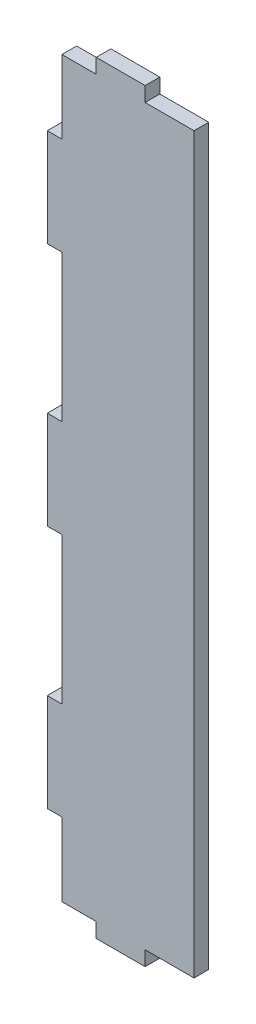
ISO-10303-21;
HEADER;
FILE_DESCRIPTION(('STEP AP214'),'2;1');
FILE_NAME('part.step','',(''),(''),'','','');
FILE_SCHEMA(('AUTOMOTIVE_DESIGN { 1 0 10303 214 1 1 1 1 }'));
ENDSEC;
DATA;
#1=APPLICATION_CONTEXT('core data for automotive mechanical design processes');
#2=APPLICATION_PROTOCOL_DEFINITION('international standard','automotive_design',2000,#1);
#3=PRODUCT_CONTEXT('',#1,'mechanical');
#4=PRODUCT('Part','Part','',(#3));
#5=PRODUCT_RELATED_PRODUCT_CATEGORY('part','',(#4));
#6=PRODUCT_DEFINITION_FORMATION('','',#4);
#7=PRODUCT_DEFINITION_CONTEXT('part definition',#1,'design');
#8=PRODUCT_DEFINITION('design','',#6,#7);
#9=PRODUCT_DEFINITION_SHAPE('','',#8);
#10=(LENGTH_UNIT() NAMED_UNIT(*) SI_UNIT(.MILLI.,.METRE.));
#11=(NAMED_UNIT(*) PLANE_ANGLE_UNIT() SI_UNIT($,.RADIAN.));
#12=(NAMED_UNIT(*) SI_UNIT($,.STERADIAN.) SOLID_ANGLE_UNIT());
#13=UNCERTAINTY_MEASURE_WITH_UNIT(LENGTH_MEASURE(1.E-05),#10,'distance_accuracy_value','');
#14=(GEOMETRIC_REPRESENTATION_CONTEXT(3) GLOBAL_UNCERTAINTY_ASSIGNED_CONTEXT((#13)) GLOBAL_UNIT_ASSIGNED_CONTEXT((#10,
#11,#12)) REPRESENTATION_CONTEXT('',''));
#15=CARTESIAN_POINT('',(0.,0.,0.));
#16=DIRECTION('',(0.,0.,1.));
#17=DIRECTION('',(1.,0.,0.));
#18=AXIS2_PLACEMENT_3D('',#15,#16,#17);
#19=CARTESIAN_POINT('',(-15.,-75.,3.));
#20=DIRECTION('',(1.,0.,0.));
#21=DIRECTION('',(0.,0.,-1.));
#22=AXIS2_PLACEMENT_3D('',#19,#20,#21);
#23=PLANE('',#22);
#24=DIRECTION('',(0.,-1.,0.));
#25=VECTOR('',#24,1.);
#26=CARTESIAN_POINT('',(-15.,-75.,0.));
#27=LINE('',#26,#25);
#28=CARTESIAN_POINT('',(-15.,60.,0.));
#29=VERTEX_POINT('',#28);
#30=CARTESIAN_POINT('',(-15.,40.,0.));
#31=VERTEX_POINT('',#30);
#32=EDGE_CURVE('E219',#29,#31,#27,.T.);
#33=ORIENTED_EDGE('',*,*,#32,.T.);
#34=DIRECTION('',(0.,0.,1.));
#35=VECTOR('',#34,1.);
#36=CARTESIAN_POINT('',(-15.,40.,0.));
#37=LINE('',#36,#35);
#38=CARTESIAN_POINT('',(-15.,40.,3.));
#39=VERTEX_POINT('',#38);
#40=EDGE_CURVE('E417',#31,#39,#37,.T.);
#41=ORIENTED_EDGE('',*,*,#40,.T.);
#42=DIRECTION('',(0.,-1.,0.));
#43=VECTOR('',#42,1.);
#44=CARTESIAN_POINT('',(-15.,-75.,3.));
#45=LINE('',#44,#43);
#46=CARTESIAN_POINT('',(-15.,60.,3.));
#47=VERTEX_POINT('',#46);
#48=EDGE_CURVE('E244',#47,#39,#45,.T.);
#49=ORIENTED_EDGE('',*,*,#48,.F.);
#50=DIRECTION('',(0.,0.,1.));
#51=VECTOR('',#50,1.);
#52=CARTESIAN_POINT('',(-15.,60.,0.));
#53=LINE('',#52,#51);
#54=EDGE_CURVE('E287',#29,#47,#53,.T.);
#55=ORIENTED_EDGE('',*,*,#54,.F.);
#56=EDGE_LOOP('',(#33,#41,#49,#55));
#57=FACE_BOUND('',#56,.T.);
#58=ADVANCED_FACE('F35',(#57),#23,.F.);
#59=CARTESIAN_POINT('',(-15.,-39.9999999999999,3.));
#60=VERTEX_POINT('',#59);
#61=CARTESIAN_POINT('',(-15.,-60.,3.));
#62=VERTEX_POINT('',#61);
#63=EDGE_CURVE('E267',#60,#62,#45,.T.);
#64=ORIENTED_EDGE('',*,*,#63,.F.);
#65=DIRECTION('',(0.,0.,1.));
#66=VECTOR('',#65,1.);
#67=CARTESIAN_POINT('',(-15.,-39.9999999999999,0.));
#68=LINE('',#67,#66);
#69=CARTESIAN_POINT('',(-15.,-39.9999999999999,0.));
#70=VERTEX_POINT('',#69);
#71=EDGE_CURVE('E444',#70,#60,#68,.T.);
#72=ORIENTED_EDGE('',*,*,#71,.F.);
#73=CARTESIAN_POINT('',(-15.,-60.,0.));
#74=VERTEX_POINT('',#73);
#75=EDGE_CURVE('E220',#70,#74,#27,.T.);
#76=ORIENTED_EDGE('',*,*,#75,.T.);
#77=DIRECTION('',(0.,0.,1.));
#78=VECTOR('',#77,1.);
#79=CARTESIAN_POINT('',(-15.,-60.,0.));
#80=LINE('',#79,#78);
#81=EDGE_CURVE('E405',#74,#62,#80,.T.);
#82=ORIENTED_EDGE('',*,*,#81,.T.);
#83=EDGE_LOOP('',(#64,#72,#76,#82));
#84=FACE_BOUND('',#83,.T.);
#85=ADVANCED_FACE('F352',(#84),#23,.F.);
#86=CARTESIAN_POINT('',(-15.,-75.,3.));
#87=DIRECTION('',(0.,1.,0.));
#88=DIRECTION('',(0.,0.,1.));
#89=AXIS2_PLACEMENT_3D('',#86,#87,#88);
#90=PLANE('',#89);
#91=DIRECTION('',(1.,0.,0.));
#92=VECTOR('',#91,1.);
#93=CARTESIAN_POINT('',(-15.,-75.,3.));
#94=LINE('',#93,#92);
#95=CARTESIAN_POINT('',(-12.,-75.,3.));
#96=VERTEX_POINT('',#95);
#97=CARTESIAN_POINT('',(-5.,-75.,3.));
#98=VERTEX_POINT('',#97);
#99=EDGE_CURVE('E232',#96,#98,#94,.T.);
#100=ORIENTED_EDGE('',*,*,#99,.F.);
#101=DIRECTION('',(0.,0.,1.));
#102=VECTOR('',#101,1.);
#103=CARTESIAN_POINT('',(-12.,-75.,0.));
#104=LINE('',#103,#102);
#105=CARTESIAN_POINT('',(-12.,-75.,0.));
#106=VERTEX_POINT('',#105);
#107=EDGE_CURVE('E399',#106,#96,#104,.T.);
#108=ORIENTED_EDGE('',*,*,#107,.F.);
#109=DIRECTION('',(1.,0.,0.));
#110=VECTOR('',#109,1.);
#111=CARTESIAN_POINT('',(-15.,-75.,0.));
#112=LINE('',#111,#110);
#113=CARTESIAN_POINT('',(-5.,-75.,0.));
#114=VERTEX_POINT('',#113);
#115=EDGE_CURVE('E229',#106,#114,#112,.T.);
#116=ORIENTED_EDGE('',*,*,#115,.T.);
#117=DIRECTION('',(0.,0.,-1.));
#118=VECTOR('',#117,1.);
#119=CARTESIAN_POINT('',(-5.,-75.,3.));
#120=LINE('',#119,#118);
#121=EDGE_CURVE('E312',#98,#114,#120,.T.);
#122=ORIENTED_EDGE('',*,*,#121,.F.);
#123=EDGE_LOOP('',(#100,#108,#116,#122));
#124=FACE_BOUND('',#123,.T.);
#125=ADVANCED_FACE('F358',(#124),#90,.F.);
#126=CARTESIAN_POINT('',(-15.,75.,3.));
#127=DIRECTION('',(0.,-1.,0.));
#128=DIRECTION('',(0.,0.,-1.));
#129=AXIS2_PLACEMENT_3D('',#126,#127,#128);
#130=PLANE('',#129);
#131=DIRECTION('',(0.,0.,-1.));
#132=VECTOR('',#131,1.);
#133=CARTESIAN_POINT('',(5.,75.,3.));
#134=LINE('',#133,#132);
#135=CARTESIAN_POINT('',(5.,75.,3.));
#136=VERTEX_POINT('',#135);
#137=CARTESIAN_POINT('',(5.,75.,0.));
#138=VERTEX_POINT('',#137);
#139=EDGE_CURVE('E253',#136,#138,#134,.T.);
#140=ORIENTED_EDGE('',*,*,#139,.F.);
#141=DIRECTION('',(-1.,0.,0.));
#142=VECTOR('',#141,1.);
#143=CARTESIAN_POINT('',(-15.,75.,3.));
#144=LINE('',#143,#142);
#145=CARTESIAN_POINT('',(15.,75.,3.));
#146=VERTEX_POINT('',#145);
#147=EDGE_CURVE('E265',#146,#136,#144,.T.);
#148=ORIENTED_EDGE('',*,*,#147,.F.);
#149=DIRECTION('',(0.,0.,-1.));
#150=VECTOR('',#149,1.);
#151=CARTESIAN_POINT('',(15.,75.,3.));
#152=LINE('',#151,#150);
#153=CARTESIAN_POINT('',(15.,75.,0.));
#154=VERTEX_POINT('',#153);
#155=EDGE_CURVE('E11',#146,#154,#152,.T.);
#156=ORIENTED_EDGE('',*,*,#155,.T.);
#157=DIRECTION('',(-1.,0.,0.));
#158=VECTOR('',#157,1.);
#159=CARTESIAN_POINT('',(-15.,75.,0.));
#160=LINE('',#159,#158);
#161=EDGE_CURVE('E225',#154,#138,#160,.T.);
#162=ORIENTED_EDGE('',*,*,#161,.T.);
#163=EDGE_LOOP('',(#140,#148,#156,#162));
#164=FACE_BOUND('',#163,.T.);
#165=ADVANCED_FACE('F368',(#164),#130,.F.);
#166=CARTESIAN_POINT('',(15.,-75.,3.));
#167=DIRECTION('',(-1.,0.,0.));
#168=DIRECTION('',(0.,0.,1.));
#169=AXIS2_PLACEMENT_3D('',#166,#167,#168);
#170=PLANE('',#169);
#171=DIRECTION('',(0.,1.,0.));
#172=VECTOR('',#171,1.);
#173=CARTESIAN_POINT('',(15.,-75.,0.));
#174=LINE('',#173,#172);
#175=CARTESIAN_POINT('',(15.,-75.,0.));
#176=VERTEX_POINT('',#175);
#177=EDGE_CURVE('E247',#176,#154,#174,.T.);
#178=ORIENTED_EDGE('',*,*,#177,.T.);
#179=ORIENTED_EDGE('',*,*,#155,.F.);
#180=DIRECTION('',(0.,1.,0.));
#181=VECTOR('',#180,1.);
#182=CARTESIAN_POINT('',(15.,-75.,3.));
#183=LINE('',#182,#181);
#184=CARTESIAN_POINT('',(15.,-75.,3.));
#185=VERTEX_POINT('',#184);
#186=EDGE_CURVE('E230',#185,#146,#183,.T.);
#187=ORIENTED_EDGE('',*,*,#186,.F.);
#188=DIRECTION('',(0.,0.,-1.));
#189=VECTOR('',#188,1.);
#190=CARTESIAN_POINT('',(15.,-75.,3.));
#191=LINE('',#190,#189);
#192=EDGE_CURVE('E43',#185,#176,#191,.T.);
#193=ORIENTED_EDGE('',*,*,#192,.T.);
#194=EDGE_LOOP('',(#178,#179,#187,#193));
#195=FACE_BOUND('',#194,.T.);
#196=ADVANCED_FACE('F37',(#195),#170,.F.);
#197=CARTESIAN_POINT('',(-5.,75.,0.));
#198=VERTEX_POINT('',#197);
#199=CARTESIAN_POINT('',(-12.,75.,0.));
#200=VERTEX_POINT('',#199);
#201=EDGE_CURVE('E248',#198,#200,#160,.T.);
#202=ORIENTED_EDGE('',*,*,#201,.T.);
#203=DIRECTION('',(0.,0.,1.));
#204=VECTOR('',#203,1.);
#205=CARTESIAN_POINT('',(-12.,75.,0.));
#206=LINE('',#205,#204);
#207=CARTESIAN_POINT('',(-12.,75.,3.));
#208=VERTEX_POINT('',#207);
#209=EDGE_CURVE('E279',#200,#208,#206,.T.);
#210=ORIENTED_EDGE('',*,*,#209,.T.);
#211=CARTESIAN_POINT('',(-5.,75.,3.));
#212=VERTEX_POINT('',#211);
#213=EDGE_CURVE('E264',#212,#208,#144,.T.);
#214=ORIENTED_EDGE('',*,*,#213,.F.);
#215=DIRECTION('',(0.,0.,-1.));
#216=VECTOR('',#215,1.);
#217=CARTESIAN_POINT('',(-5.,75.,3.));
#218=LINE('',#217,#216);
#219=EDGE_CURVE('E249',#212,#198,#218,.T.);
#220=ORIENTED_EDGE('',*,*,#219,.T.);
#221=EDGE_LOOP('',(#202,#210,#214,#220));
#222=FACE_BOUND('',#221,.T.);
#223=ADVANCED_FACE('F278',(#222),#130,.F.);
#224=CARTESIAN_POINT('',(-15.,10.,3.));
#225=VERTEX_POINT('',#224);
#226=CARTESIAN_POINT('',(-15.,-9.99999999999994,3.));
#227=VERTEX_POINT('',#226);
#228=EDGE_CURVE('E213',#225,#227,#45,.T.);
#229=ORIENTED_EDGE('',*,*,#228,.F.);
#230=DIRECTION('',(0.,0.,1.));
#231=VECTOR('',#230,1.);
#232=CARTESIAN_POINT('',(-15.,10.,0.));
#233=LINE('',#232,#231);
#234=CARTESIAN_POINT('',(-15.,10.,0.));
#235=VERTEX_POINT('',#234);
#236=EDGE_CURVE('E199',#235,#225,#233,.T.);
#237=ORIENTED_EDGE('',*,*,#236,.F.);
#238=CARTESIAN_POINT('',(-15.,-9.99999999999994,0.));
#239=VERTEX_POINT('',#238);
#240=EDGE_CURVE('E211',#235,#239,#27,.T.);
#241=ORIENTED_EDGE('',*,*,#240,.T.);
#242=DIRECTION('',(0.,0.,1.));
#243=VECTOR('',#242,1.);
#244=CARTESIAN_POINT('',(-15.,-9.99999999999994,0.));
#245=LINE('',#244,#243);
#246=EDGE_CURVE('E447',#239,#227,#245,.T.);
#247=ORIENTED_EDGE('',*,*,#246,.T.);
#248=EDGE_LOOP('',(#229,#237,#241,#247));
#249=FACE_BOUND('',#248,.T.);
#250=ADVANCED_FACE('F209',(#249),#23,.F.);
#251=CARTESIAN_POINT('',(5.,-75.,3.));
#252=VERTEX_POINT('',#251);
#253=EDGE_CURVE('E238',#252,#185,#94,.T.);
#254=ORIENTED_EDGE('',*,*,#253,.F.);
#255=DIRECTION('',(0.,0.,-1.));
#256=VECTOR('',#255,1.);
#257=CARTESIAN_POINT('',(5.,-75.,3.));
#258=LINE('',#257,#256);
#259=CARTESIAN_POINT('',(5.,-75.,0.));
#260=VERTEX_POINT('',#259);
#261=EDGE_CURVE('E300',#252,#260,#258,.T.);
#262=ORIENTED_EDGE('',*,*,#261,.T.);
#263=EDGE_CURVE('E223',#260,#176,#112,.T.);
#264=ORIENTED_EDGE('',*,*,#263,.T.);
#265=ORIENTED_EDGE('',*,*,#192,.F.);
#266=EDGE_LOOP('',(#254,#262,#264,#265));
#267=FACE_BOUND('',#266,.T.);
#268=ADVANCED_FACE('F362',(#267),#90,.F.);
#269=CARTESIAN_POINT('',(0.,0.,3.));
#270=DIRECTION('',(0.,0.,-1.));
#271=DIRECTION('',(-1.,0.,0.));
#272=AXIS2_PLACEMENT_3D('',#269,#270,#271);
#273=PLANE('',#272);
#274=ORIENTED_EDGE('',*,*,#48,.T.);
#275=DIRECTION('',(-1.,0.,0.));
#276=VECTOR('',#275,1.);
#277=CARTESIAN_POINT('',(-15.,40.,3.));
#278=LINE('',#277,#276);
#279=CARTESIAN_POINT('',(-12.,40.,3.));
#280=VERTEX_POINT('',#279);
#281=EDGE_CURVE('E204',#280,#39,#278,.T.);
#282=ORIENTED_EDGE('',*,*,#281,.F.);
#283=DIRECTION('',(0.,1.,0.));
#284=VECTOR('',#283,1.);
#285=CARTESIAN_POINT('',(-12.,40.,3.));
#286=LINE('',#285,#284);
#287=CARTESIAN_POINT('',(-12.,10.,3.));
#288=VERTEX_POINT('',#287);
#289=EDGE_CURVE('E584',#288,#280,#286,.T.);
#290=ORIENTED_EDGE('',*,*,#289,.F.);
#291=DIRECTION('',(1.,0.,0.));
#292=VECTOR('',#291,1.);
#293=CARTESIAN_POINT('',(-15.,10.,3.));
#294=LINE('',#293,#292);
#295=EDGE_CURVE('E446',#225,#288,#294,.T.);
#296=ORIENTED_EDGE('',*,*,#295,.F.);
#297=ORIENTED_EDGE('',*,*,#228,.T.);
#298=DIRECTION('',(-1.,0.,0.));
#299=VECTOR('',#298,1.);
#300=CARTESIAN_POINT('',(-15.,-9.99999999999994,3.));
#301=LINE('',#300,#299);
#302=CARTESIAN_POINT('',(-12.,-9.99999999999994,3.));
#303=VERTEX_POINT('',#302);
#304=EDGE_CURVE('E433',#303,#227,#301,.T.);
#305=ORIENTED_EDGE('',*,*,#304,.F.);
#306=DIRECTION('',(0.,1.,0.));
#307=VECTOR('',#306,1.);
#308=CARTESIAN_POINT('',(-12.,-39.9999999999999,3.));
#309=LINE('',#308,#307);
#310=CARTESIAN_POINT('',(-12.,-39.9999999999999,3.));
#311=VERTEX_POINT('',#310);
#312=EDGE_CURVE('E440',#311,#303,#309,.T.);
#313=ORIENTED_EDGE('',*,*,#312,.F.);
#314=DIRECTION('',(1.,0.,0.));
#315=VECTOR('',#314,1.);
#316=CARTESIAN_POINT('',(-15.,-39.9999999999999,3.));
#317=LINE('',#316,#315);
#318=EDGE_CURVE('E437',#60,#311,#317,.T.);
#319=ORIENTED_EDGE('',*,*,#318,.F.);
#320=ORIENTED_EDGE('',*,*,#63,.T.);
#321=DIRECTION('',(-1.,0.,0.));
#322=VECTOR('',#321,1.);
#323=CARTESIAN_POINT('',(-15.,-60.,3.));
#324=LINE('',#323,#322);
#325=CARTESIAN_POINT('',(-12.,-60.,3.));
#326=VERTEX_POINT('',#325);
#327=EDGE_CURVE('E452',#326,#62,#324,.T.);
#328=ORIENTED_EDGE('',*,*,#327,.F.);
#329=DIRECTION('',(0.,1.,0.));
#330=VECTOR('',#329,1.);
#331=CARTESIAN_POINT('',(-12.,-75.,3.));
#332=LINE('',#331,#330);
#333=EDGE_CURVE('E454',#96,#326,#332,.T.);
#334=ORIENTED_EDGE('',*,*,#333,.F.);
#335=ORIENTED_EDGE('',*,*,#99,.T.);
#336=DIRECTION('',(0.,-1.,0.));
#337=VECTOR('',#336,1.);
#338=CARTESIAN_POINT('',(-5.,-75.,3.));
#339=LINE('',#338,#337);
#340=CARTESIAN_POINT('',(-5.00000000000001,-78.,3.));
#341=VERTEX_POINT('',#340);
#342=EDGE_CURVE('E294',#98,#341,#339,.T.);
#343=ORIENTED_EDGE('',*,*,#342,.T.);
#344=DIRECTION('',(1.,0.,0.));
#345=VECTOR('',#344,1.);
#346=CARTESIAN_POINT('',(-5.00000000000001,-78.,3.));
#347=LINE('',#346,#345);
#348=CARTESIAN_POINT('',(4.99999999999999,-78.,3.));
#349=VERTEX_POINT('',#348);
#350=EDGE_CURVE('E296',#341,#349,#347,.T.);
#351=ORIENTED_EDGE('',*,*,#350,.T.);
#352=DIRECTION('',(0.,1.,0.));
#353=VECTOR('',#352,1.);
#354=CARTESIAN_POINT('',(5.,-75.,3.));
#355=LINE('',#354,#353);
#356=EDGE_CURVE('E299',#349,#252,#355,.T.);
#357=ORIENTED_EDGE('',*,*,#356,.T.);
#358=ORIENTED_EDGE('',*,*,#253,.T.);
#359=ORIENTED_EDGE('',*,*,#186,.T.);
#360=ORIENTED_EDGE('',*,*,#147,.T.);
#361=DIRECTION('',(0.,1.,0.));
#362=VECTOR('',#361,1.);
#363=CARTESIAN_POINT('',(5.,75.,3.));
#364=LINE('',#363,#362);
#365=CARTESIAN_POINT('',(4.99999999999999,78.,3.));
#366=VERTEX_POINT('',#365);
#367=EDGE_CURVE('E317',#136,#366,#364,.T.);
#368=ORIENTED_EDGE('',*,*,#367,.T.);
#369=DIRECTION('',(-1.,0.,0.));
#370=VECTOR('',#369,1.);
#371=CARTESIAN_POINT('',(-5.00000000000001,78.,3.));
#372=LINE('',#371,#370);
#373=CARTESIAN_POINT('',(-5.00000000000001,78.,3.));
#374=VERTEX_POINT('',#373);
#375=EDGE_CURVE('E320',#366,#374,#372,.T.);
#376=ORIENTED_EDGE('',*,*,#375,.T.);
#377=DIRECTION('',(0.,-1.,0.));
#378=VECTOR('',#377,1.);
#379=CARTESIAN_POINT('',(-5.,75.,3.));
#380=LINE('',#379,#378);
#381=EDGE_CURVE('E276',#374,#212,#380,.T.);
#382=ORIENTED_EDGE('',*,*,#381,.T.);
#383=ORIENTED_EDGE('',*,*,#213,.T.);
#384=DIRECTION('',(0.,1.,0.));
#385=VECTOR('',#384,1.);
#386=CARTESIAN_POINT('',(-12.,75.,3.));
#387=LINE('',#386,#385);
#388=CARTESIAN_POINT('',(-12.,60.,3.));
#389=VERTEX_POINT('',#388);
#390=EDGE_CURVE('E274',#389,#208,#387,.T.);
#391=ORIENTED_EDGE('',*,*,#390,.F.);
#392=DIRECTION('',(1.,0.,0.));
#393=VECTOR('',#392,1.);
#394=CARTESIAN_POINT('',(-15.,60.,3.));
#395=LINE('',#394,#393);
#396=EDGE_CURVE('E415',#47,#389,#395,.T.);
#397=ORIENTED_EDGE('',*,*,#396,.F.);
#398=EDGE_LOOP('',(#274,#282,#290,#296,#297,#305,#313,#319,#320,#328,#334,#335,#343,#351,#357,
#358,#359,#360,#368,#376,#382,#383,#391,#397));
#399=FACE_BOUND('',#398,.T.);
#400=ADVANCED_FACE('F272',(#399),#273,.F.);
#401=CARTESIAN_POINT('',(0.,0.,0.));
#402=DIRECTION('',(0.,0.,-1.));
#403=DIRECTION('',(-1.,0.,0.));
#404=AXIS2_PLACEMENT_3D('',#401,#402,#403);
#405=PLANE('',#404);
#406=DIRECTION('',(-1.,0.,0.));
#407=VECTOR('',#406,1.);
#408=CARTESIAN_POINT('',(-15.,40.,0.));
#409=LINE('',#408,#407);
#410=CARTESIAN_POINT('',(-12.,40.,0.));
#411=VERTEX_POINT('',#410);
#412=EDGE_CURVE('E214',#411,#31,#409,.T.);
#413=ORIENTED_EDGE('',*,*,#412,.T.);
#414=ORIENTED_EDGE('',*,*,#32,.F.);
#415=DIRECTION('',(1.,0.,0.));
#416=VECTOR('',#415,1.);
#417=CARTESIAN_POINT('',(-15.,60.,0.));
#418=LINE('',#417,#416);
#419=CARTESIAN_POINT('',(-12.,60.,0.));
#420=VERTEX_POINT('',#419);
#421=EDGE_CURVE('E412',#29,#420,#418,.T.);
#422=ORIENTED_EDGE('',*,*,#421,.T.);
#423=DIRECTION('',(0.,1.,0.));
#424=VECTOR('',#423,1.);
#425=CARTESIAN_POINT('',(-12.,75.,0.));
#426=LINE('',#425,#424);
#427=EDGE_CURVE('E293',#420,#200,#426,.T.);
#428=ORIENTED_EDGE('',*,*,#427,.T.);
#429=ORIENTED_EDGE('',*,*,#201,.F.);
#430=DIRECTION('',(0.,-1.,0.));
#431=VECTOR('',#430,1.);
#432=CARTESIAN_POINT('',(-5.,75.,0.));
#433=LINE('',#432,#431);
#434=CARTESIAN_POINT('',(-5.00000000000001,78.,0.));
#435=VERTEX_POINT('',#434);
#436=EDGE_CURVE('E315',#435,#198,#433,.T.);
#437=ORIENTED_EDGE('',*,*,#436,.F.);
#438=DIRECTION('',(-1.,0.,0.));
#439=VECTOR('',#438,1.);
#440=CARTESIAN_POINT('',(-5.00000000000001,78.,0.));
#441=LINE('',#440,#439);
#442=CARTESIAN_POINT('',(4.99999999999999,78.,0.));
#443=VERTEX_POINT('',#442);
#444=EDGE_CURVE('E318',#443,#435,#441,.T.);
#445=ORIENTED_EDGE('',*,*,#444,.F.);
#446=DIRECTION('',(0.,1.,0.));
#447=VECTOR('',#446,1.);
#448=CARTESIAN_POINT('',(5.,75.,0.));
#449=LINE('',#448,#447);
#450=EDGE_CURVE('E324',#138,#443,#449,.T.);
#451=ORIENTED_EDGE('',*,*,#450,.F.);
#452=ORIENTED_EDGE('',*,*,#161,.F.);
#453=ORIENTED_EDGE('',*,*,#177,.F.);
#454=ORIENTED_EDGE('',*,*,#263,.F.);
#455=DIRECTION('',(0.,1.,0.));
#456=VECTOR('',#455,1.);
#457=CARTESIAN_POINT('',(5.,-75.,0.));
#458=LINE('',#457,#456);
#459=CARTESIAN_POINT('',(4.99999999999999,-78.,0.));
#460=VERTEX_POINT('',#459);
#461=EDGE_CURVE('E297',#460,#260,#458,.T.);
#462=ORIENTED_EDGE('',*,*,#461,.F.);
#463=DIRECTION('',(1.,0.,0.));
#464=VECTOR('',#463,1.);
#465=CARTESIAN_POINT('',(-5.00000000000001,-78.,0.));
#466=LINE('',#465,#464);
#467=CARTESIAN_POINT('',(-5.00000000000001,-78.,0.));
#468=VERTEX_POINT('',#467);
#469=EDGE_CURVE('E285',#468,#460,#466,.T.);
#470=ORIENTED_EDGE('',*,*,#469,.F.);
#471=DIRECTION('',(0.,-1.,0.));
#472=VECTOR('',#471,1.);
#473=CARTESIAN_POINT('',(-5.,-75.,0.));
#474=LINE('',#473,#472);
#475=EDGE_CURVE('E282',#114,#468,#474,.T.);
#476=ORIENTED_EDGE('',*,*,#475,.F.);
#477=ORIENTED_EDGE('',*,*,#115,.F.);
#478=DIRECTION('',(0.,1.,0.));
#479=VECTOR('',#478,1.);
#480=CARTESIAN_POINT('',(-12.,-75.,0.));
#481=LINE('',#480,#479);
#482=CARTESIAN_POINT('',(-12.,-60.,0.));
#483=VERTEX_POINT('',#482);
#484=EDGE_CURVE('E408',#106,#483,#481,.T.);
#485=ORIENTED_EDGE('',*,*,#484,.T.);
#486=DIRECTION('',(-1.,0.,0.));
#487=VECTOR('',#486,1.);
#488=CARTESIAN_POINT('',(-15.,-60.,0.));
#489=LINE('',#488,#487);
#490=EDGE_CURVE('E403',#483,#74,#489,.T.);
#491=ORIENTED_EDGE('',*,*,#490,.T.);
#492=ORIENTED_EDGE('',*,*,#75,.F.);
#493=DIRECTION('',(1.,0.,0.));
#494=VECTOR('',#493,1.);
#495=CARTESIAN_POINT('',(-15.,-39.9999999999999,0.));
#496=LINE('',#495,#494);
#497=CARTESIAN_POINT('',(-12.,-39.9999999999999,0.));
#498=VERTEX_POINT('',#497);
#499=EDGE_CURVE('E429',#70,#498,#496,.T.);
#500=ORIENTED_EDGE('',*,*,#499,.T.);
#501=DIRECTION('',(0.,1.,0.));
#502=VECTOR('',#501,1.);
#503=CARTESIAN_POINT('',(-12.,-39.9999999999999,0.));
#504=LINE('',#503,#502);
#505=CARTESIAN_POINT('',(-12.,-9.99999999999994,0.));
#506=VERTEX_POINT('',#505);
#507=EDGE_CURVE('E432',#498,#506,#504,.T.);
#508=ORIENTED_EDGE('',*,*,#507,.T.);
#509=DIRECTION('',(-1.,0.,0.));
#510=VECTOR('',#509,1.);
#511=CARTESIAN_POINT('',(-15.,-9.99999999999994,0.));
#512=LINE('',#511,#510);
#513=EDGE_CURVE('E58',#506,#239,#512,.T.);
#514=ORIENTED_EDGE('',*,*,#513,.T.);
#515=ORIENTED_EDGE('',*,*,#240,.F.);
#516=DIRECTION('',(1.,0.,0.));
#517=VECTOR('',#516,1.);
#518=CARTESIAN_POINT('',(-15.,10.,0.));
#519=LINE('',#518,#517);
#520=CARTESIAN_POINT('',(-12.,10.,0.));
#521=VERTEX_POINT('',#520);
#522=EDGE_CURVE('E195',#235,#521,#519,.T.);
#523=ORIENTED_EDGE('',*,*,#522,.T.);
#524=DIRECTION('',(0.,1.,0.));
#525=VECTOR('',#524,1.);
#526=CARTESIAN_POINT('',(-12.,40.,0.));
#527=LINE('',#526,#525);
#528=EDGE_CURVE('E50',#521,#411,#527,.T.);
#529=ORIENTED_EDGE('',*,*,#528,.T.);
#530=EDGE_LOOP('',(#413,#414,#422,#428,#429,#437,#445,#451,#452,#453,#454,#462,#470,#476,#477,
#485,#491,#492,#500,#508,#514,#515,#523,#529));
#531=FACE_BOUND('',#530,.T.);
#532=ADVANCED_FACE('F217',(#531),#405,.T.);
#533=CARTESIAN_POINT('',(-5.,75.,3.));
#534=DIRECTION('',(1.,0.,0.));
#535=DIRECTION('',(0.,1.,0.));
#536=AXIS2_PLACEMENT_3D('',#533,#534,#535);
#537=PLANE('',#536);
#538=ORIENTED_EDGE('',*,*,#436,.T.);
#539=ORIENTED_EDGE('',*,*,#219,.F.);
#540=ORIENTED_EDGE('',*,*,#381,.F.);
#541=DIRECTION('',(0.,0.,-1.));
#542=VECTOR('',#541,1.);
#543=CARTESIAN_POINT('',(-5.00000000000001,78.,3.));
#544=LINE('',#543,#542);
#545=EDGE_CURVE('E322',#374,#435,#544,.T.);
#546=ORIENTED_EDGE('',*,*,#545,.T.);
#547=EDGE_LOOP('',(#538,#539,#540,#546));
#548=FACE_BOUND('',#547,.T.);
#549=ADVANCED_FACE('F340',(#548),#537,.F.);
#550=CARTESIAN_POINT('',(5.,75.,3.));
#551=DIRECTION('',(-1.,0.,0.));
#552=DIRECTION('',(0.,-1.,0.));
#553=AXIS2_PLACEMENT_3D('',#550,#551,#552);
#554=PLANE('',#553);
#555=ORIENTED_EDGE('',*,*,#450,.T.);
#556=DIRECTION('',(0.,0.,-1.));
#557=VECTOR('',#556,1.);
#558=CARTESIAN_POINT('',(4.99999999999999,78.,3.));
#559=LINE('',#558,#557);
#560=EDGE_CURVE('E259',#366,#443,#559,.T.);
#561=ORIENTED_EDGE('',*,*,#560,.F.);
#562=ORIENTED_EDGE('',*,*,#367,.F.);
#563=ORIENTED_EDGE('',*,*,#139,.T.);
#564=EDGE_LOOP('',(#555,#561,#562,#563));
#565=FACE_BOUND('',#564,.T.);
#566=ADVANCED_FACE('F342',(#565),#554,.F.);
#567=CARTESIAN_POINT('',(-5.00000000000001,78.,3.));
#568=DIRECTION('',(0.,-1.,0.));
#569=DIRECTION('',(0.,0.,-1.));
#570=AXIS2_PLACEMENT_3D('',#567,#568,#569);
#571=PLANE('',#570);
#572=ORIENTED_EDGE('',*,*,#444,.T.);
#573=ORIENTED_EDGE('',*,*,#545,.F.);
#574=ORIENTED_EDGE('',*,*,#375,.F.);
#575=ORIENTED_EDGE('',*,*,#560,.T.);
#576=EDGE_LOOP('',(#572,#573,#574,#575));
#577=FACE_BOUND('',#576,.T.);
#578=ADVANCED_FACE('F333',(#577),#571,.F.);
#579=CARTESIAN_POINT('',(-5.,-75.,3.));
#580=DIRECTION('',(1.,0.,0.));
#581=DIRECTION('',(0.,1.,0.));
#582=AXIS2_PLACEMENT_3D('',#579,#580,#581);
#583=PLANE('',#582);
#584=ORIENTED_EDGE('',*,*,#475,.T.);
#585=DIRECTION('',(0.,0.,-1.));
#586=VECTOR('',#585,1.);
#587=CARTESIAN_POINT('',(-5.00000000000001,-78.,3.));
#588=LINE('',#587,#586);
#589=EDGE_CURVE('E309',#341,#468,#588,.T.);
#590=ORIENTED_EDGE('',*,*,#589,.F.);
#591=ORIENTED_EDGE('',*,*,#342,.F.);
#592=ORIENTED_EDGE('',*,*,#121,.T.);
#593=EDGE_LOOP('',(#584,#590,#591,#592));
#594=FACE_BOUND('',#593,.T.);
#595=ADVANCED_FACE('F397',(#594),#583,.F.);
#596=CARTESIAN_POINT('',(-5.00000000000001,-78.,3.));
#597=DIRECTION('',(0.,1.,0.));
#598=DIRECTION('',(0.,0.,1.));
#599=AXIS2_PLACEMENT_3D('',#596,#597,#598);
#600=PLANE('',#599);
#601=ORIENTED_EDGE('',*,*,#469,.T.);
#602=DIRECTION('',(0.,0.,-1.));
#603=VECTOR('',#602,1.);
#604=CARTESIAN_POINT('',(4.99999999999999,-78.,3.));
#605=LINE('',#604,#603);
#606=EDGE_CURVE('E306',#349,#460,#605,.T.);
#607=ORIENTED_EDGE('',*,*,#606,.F.);
#608=ORIENTED_EDGE('',*,*,#350,.F.);
#609=ORIENTED_EDGE('',*,*,#589,.T.);
#610=EDGE_LOOP('',(#601,#607,#608,#609));
#611=FACE_BOUND('',#610,.T.);
#612=ADVANCED_FACE('F390',(#611),#600,.F.);
#613=CARTESIAN_POINT('',(5.,-75.,3.));
#614=DIRECTION('',(-1.,0.,0.));
#615=DIRECTION('',(0.,-1.,0.));
#616=AXIS2_PLACEMENT_3D('',#613,#614,#615);
#617=PLANE('',#616);
#618=ORIENTED_EDGE('',*,*,#461,.T.);
#619=ORIENTED_EDGE('',*,*,#261,.F.);
#620=ORIENTED_EDGE('',*,*,#356,.F.);
#621=ORIENTED_EDGE('',*,*,#606,.T.);
#622=EDGE_LOOP('',(#618,#619,#620,#621));
#623=FACE_BOUND('',#622,.T.);
#624=ADVANCED_FACE('F386',(#623),#617,.F.);
#625=CARTESIAN_POINT('',(-12.,75.,0.));
#626=DIRECTION('',(1.,0.,0.));
#627=DIRECTION('',(0.,1.,0.));
#628=AXIS2_PLACEMENT_3D('',#625,#626,#627);
#629=PLANE('',#628);
#630=ORIENTED_EDGE('',*,*,#390,.T.);
#631=ORIENTED_EDGE('',*,*,#209,.F.);
#632=ORIENTED_EDGE('',*,*,#427,.F.);
#633=DIRECTION('',(0.,0.,1.));
#634=VECTOR('',#633,1.);
#635=CARTESIAN_POINT('',(-12.,60.,0.));
#636=LINE('',#635,#634);
#637=EDGE_CURVE('E283',#420,#389,#636,.T.);
#638=ORIENTED_EDGE('',*,*,#637,.T.);
#639=EDGE_LOOP('',(#630,#631,#632,#638));
#640=FACE_BOUND('',#639,.T.);
#641=ADVANCED_FACE('F482',(#640),#629,.F.);
#642=CARTESIAN_POINT('',(-15.,60.,0.));
#643=DIRECTION('',(0.,-1.,0.));
#644=DIRECTION('',(0.,0.,-1.));
#645=AXIS2_PLACEMENT_3D('',#642,#643,#644);
#646=PLANE('',#645);
#647=ORIENTED_EDGE('',*,*,#396,.T.);
#648=ORIENTED_EDGE('',*,*,#637,.F.);
#649=ORIENTED_EDGE('',*,*,#421,.F.);
#650=ORIENTED_EDGE('',*,*,#54,.T.);
#651=EDGE_LOOP('',(#647,#648,#649,#650));
#652=FACE_BOUND('',#651,.T.);
#653=ADVANCED_FACE('F479',(#652),#646,.F.);
#654=CARTESIAN_POINT('',(-15.,-60.,0.));
#655=DIRECTION('',(0.,1.,0.));
#656=DIRECTION('',(0.,0.,1.));
#657=AXIS2_PLACEMENT_3D('',#654,#655,#656);
#658=PLANE('',#657);
#659=ORIENTED_EDGE('',*,*,#327,.T.);
#660=ORIENTED_EDGE('',*,*,#81,.F.);
#661=ORIENTED_EDGE('',*,*,#490,.F.);
#662=DIRECTION('',(0.,0.,1.));
#663=VECTOR('',#662,1.);
#664=CARTESIAN_POINT('',(-12.,-60.,0.));
#665=LINE('',#664,#663);
#666=EDGE_CURVE('E402',#483,#326,#665,.T.);
#667=ORIENTED_EDGE('',*,*,#666,.T.);
#668=EDGE_LOOP('',(#659,#660,#661,#667));
#669=FACE_BOUND('',#668,.T.);
#670=ADVANCED_FACE('F469',(#669),#658,.F.);
#671=CARTESIAN_POINT('',(-12.,-75.,0.));
#672=DIRECTION('',(1.,0.,0.));
#673=DIRECTION('',(0.,1.,0.));
#674=AXIS2_PLACEMENT_3D('',#671,#672,#673);
#675=PLANE('',#674);
#676=ORIENTED_EDGE('',*,*,#333,.T.);
#677=ORIENTED_EDGE('',*,*,#666,.F.);
#678=ORIENTED_EDGE('',*,*,#484,.F.);
#679=ORIENTED_EDGE('',*,*,#107,.T.);
#680=EDGE_LOOP('',(#676,#677,#678,#679));
#681=FACE_BOUND('',#680,.T.);
#682=ADVANCED_FACE('F470',(#681),#675,.F.);
#683=CARTESIAN_POINT('',(-15.,-39.9999999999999,0.));
#684=DIRECTION('',(0.,-1.,0.));
#685=DIRECTION('',(0.,0.,-1.));
#686=AXIS2_PLACEMENT_3D('',#683,#684,#685);
#687=PLANE('',#686);
#688=ORIENTED_EDGE('',*,*,#318,.T.);
#689=DIRECTION('',(0.,0.,1.));
#690=VECTOR('',#689,1.);
#691=CARTESIAN_POINT('',(-12.,-39.9999999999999,0.));
#692=LINE('',#691,#690);
#693=EDGE_CURVE('E436',#498,#311,#692,.T.);
#694=ORIENTED_EDGE('',*,*,#693,.F.);
#695=ORIENTED_EDGE('',*,*,#499,.F.);
#696=ORIENTED_EDGE('',*,*,#71,.T.);
#697=EDGE_LOOP('',(#688,#694,#695,#696));
#698=FACE_BOUND('',#697,.T.);
#699=ADVANCED_FACE('F466',(#698),#687,.F.);
#700=CARTESIAN_POINT('',(-15.,-9.99999999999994,0.));
#701=DIRECTION('',(0.,1.,0.));
#702=DIRECTION('',(-1.,0.,0.));
#703=AXIS2_PLACEMENT_3D('',#700,#701,#702);
#704=PLANE('',#703);
#705=ORIENTED_EDGE('',*,*,#304,.T.);
#706=ORIENTED_EDGE('',*,*,#246,.F.);
#707=ORIENTED_EDGE('',*,*,#513,.F.);
#708=DIRECTION('',(0.,0.,1.));
#709=VECTOR('',#708,1.);
#710=CARTESIAN_POINT('',(-12.,-9.99999999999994,0.));
#711=LINE('',#710,#709);
#712=EDGE_CURVE('E449',#506,#303,#711,.T.);
#713=ORIENTED_EDGE('',*,*,#712,.T.);
#714=EDGE_LOOP('',(#705,#706,#707,#713));
#715=FACE_BOUND('',#714,.T.);
#716=ADVANCED_FACE('F477',(#715),#704,.F.);
#717=CARTESIAN_POINT('',(-12.,-39.9999999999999,0.));
#718=DIRECTION('',(1.,0.,0.));
#719=DIRECTION('',(0.,1.,0.));
#720=AXIS2_PLACEMENT_3D('',#717,#718,#719);
#721=PLANE('',#720);
#722=ORIENTED_EDGE('',*,*,#312,.T.);
#723=ORIENTED_EDGE('',*,*,#712,.F.);
#724=ORIENTED_EDGE('',*,*,#507,.F.);
#725=ORIENTED_EDGE('',*,*,#693,.T.);
#726=EDGE_LOOP('',(#722,#723,#724,#725));
#727=FACE_BOUND('',#726,.T.);
#728=ADVANCED_FACE('F542',(#727),#721,.F.);
#729=CARTESIAN_POINT('',(-15.,40.,0.));
#730=DIRECTION('',(0.,1.,0.));
#731=DIRECTION('',(0.,0.,1.));
#732=AXIS2_PLACEMENT_3D('',#729,#730,#731);
#733=PLANE('',#732);
#734=ORIENTED_EDGE('',*,*,#281,.T.);
#735=ORIENTED_EDGE('',*,*,#40,.F.);
#736=ORIENTED_EDGE('',*,*,#412,.F.);
#737=DIRECTION('',(0.,0.,1.));
#738=VECTOR('',#737,1.);
#739=CARTESIAN_POINT('',(-12.,40.,0.));
#740=LINE('',#739,#738);
#741=EDGE_CURVE('E421',#411,#280,#740,.T.);
#742=ORIENTED_EDGE('',*,*,#741,.T.);
#743=EDGE_LOOP('',(#734,#735,#736,#742));
#744=FACE_BOUND('',#743,.T.);
#745=ADVANCED_FACE('F551',(#744),#733,.F.);
#746=CARTESIAN_POINT('',(-12.,40.,0.));
#747=DIRECTION('',(1.,0.,0.));
#748=DIRECTION('',(0.,1.,0.));
#749=AXIS2_PLACEMENT_3D('',#746,#747,#748);
#750=PLANE('',#749);
#751=ORIENTED_EDGE('',*,*,#289,.T.);
#752=ORIENTED_EDGE('',*,*,#741,.F.);
#753=ORIENTED_EDGE('',*,*,#528,.F.);
#754=DIRECTION('',(0.,0.,1.));
#755=VECTOR('',#754,1.);
#756=CARTESIAN_POINT('',(-12.,10.,0.));
#757=LINE('',#756,#755);
#758=EDGE_CURVE('E201',#521,#288,#757,.T.);
#759=ORIENTED_EDGE('',*,*,#758,.T.);
#760=EDGE_LOOP('',(#751,#752,#753,#759));
#761=FACE_BOUND('',#760,.T.);
#762=ADVANCED_FACE('F561',(#761),#750,.F.);
#763=CARTESIAN_POINT('',(-15.,10.,0.));
#764=DIRECTION('',(0.,-1.,0.));
#765=DIRECTION('',(1.,0.,0.));
#766=AXIS2_PLACEMENT_3D('',#763,#764,#765);
#767=PLANE('',#766);
#768=ORIENTED_EDGE('',*,*,#295,.T.);
#769=ORIENTED_EDGE('',*,*,#758,.F.);
#770=ORIENTED_EDGE('',*,*,#522,.F.);
#771=ORIENTED_EDGE('',*,*,#236,.T.);
#772=EDGE_LOOP('',(#768,#769,#770,#771));
#773=FACE_BOUND('',#772,.T.);
#774=ADVANCED_FACE('F198',(#773),#767,.F.);
#775=CLOSED_SHELL('',(#58,#85,#125,#165,#196,#223,#250,#268,#400,#532,#549,#566,#578,#595,#612,
#624,#641,#653,#670,#682,#699,#716,#728,#745,#762,#774));
#776=MANIFOLD_SOLID_BREP('B2',#775);
#777=ADVANCED_BREP_SHAPE_REPRESENTATION('',(#18,#776),#14);
#778=SHAPE_DEFINITION_REPRESENTATION(#9,#777);
ENDSEC;
END-ISO-10303-21;
